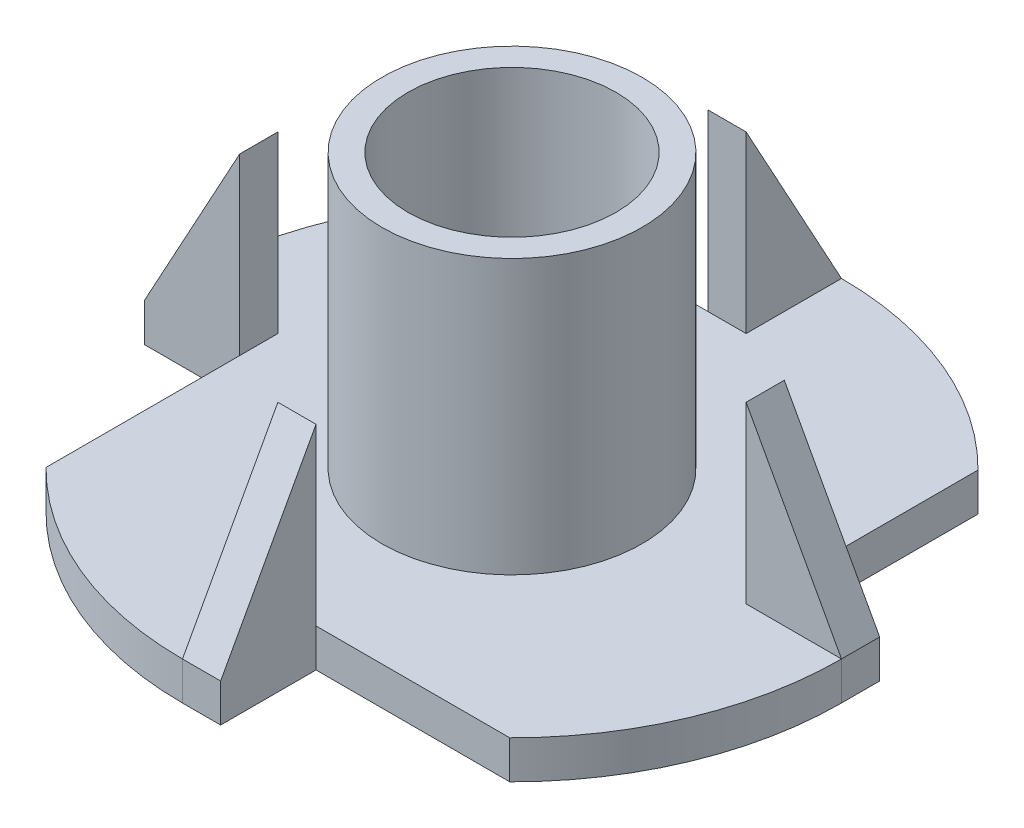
ISO-10303-21;
HEADER;
FILE_DESCRIPTION(('STEP AP214'),'2;1');
FILE_NAME('part.step','',(''),(''),'','','');
FILE_SCHEMA(('AUTOMOTIVE_DESIGN { 1 0 10303 214 1 1 1 1 }'));
ENDSEC;
DATA;
#1=APPLICATION_CONTEXT('core data for automotive mechanical design processes');
#2=APPLICATION_PROTOCOL_DEFINITION('international standard','automotive_design',2000,#1);
#3=PRODUCT_CONTEXT('',#1,'mechanical');
#4=PRODUCT('Part','Part','',(#3));
#5=PRODUCT_RELATED_PRODUCT_CATEGORY('part','',(#4));
#6=PRODUCT_DEFINITION_FORMATION('','',#4);
#7=PRODUCT_DEFINITION_CONTEXT('part definition',#1,'design');
#8=PRODUCT_DEFINITION('design','',#6,#7);
#9=PRODUCT_DEFINITION_SHAPE('','',#8);
#10=(LENGTH_UNIT() NAMED_UNIT(*) SI_UNIT(.MILLI.,.METRE.));
#11=(NAMED_UNIT(*) PLANE_ANGLE_UNIT() SI_UNIT($,.RADIAN.));
#12=(NAMED_UNIT(*) SI_UNIT($,.STERADIAN.) SOLID_ANGLE_UNIT());
#13=UNCERTAINTY_MEASURE_WITH_UNIT(LENGTH_MEASURE(1.E-05),#10,'distance_accuracy_value','');
#14=(GEOMETRIC_REPRESENTATION_CONTEXT(3) GLOBAL_UNCERTAINTY_ASSIGNED_CONTEXT((#13)) GLOBAL_UNIT_ASSIGNED_CONTEXT((#10,
#11,#12)) REPRESENTATION_CONTEXT('',''));
#15=CARTESIAN_POINT('',(0.,0.,0.));
#16=DIRECTION('',(0.,0.,1.));
#17=DIRECTION('',(1.,0.,0.));
#18=AXIS2_PLACEMENT_3D('',#15,#16,#17);
#19=CARTESIAN_POINT('',(0.,0.,0.));
#20=DIRECTION('',(0.,-1.,0.));
#21=DIRECTION('',(0.,0.,-1.));
#22=AXIS2_PLACEMENT_3D('',#19,#20,#21);
#23=CYLINDRICAL_SURFACE('',#22,9.5);
#24=CARTESIAN_POINT('',(0.,1.1,0.));
#25=DIRECTION('',(0.,-1.,0.));
#26=DIRECTION('',(0.,0.,-1.));
#27=AXIS2_PLACEMENT_3D('',#24,#25,#26);
#28=CIRCLE('',#27,9.5);
#29=CARTESIAN_POINT('',(0.,1.1,9.5));
#30=VERTEX_POINT('',#29);
#31=CARTESIAN_POINT('',(-6.75,1.1,6.68487097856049));
#32=VERTEX_POINT('',#31);
#33=EDGE_CURVE('E326',#30,#32,#28,.T.);
#34=ORIENTED_EDGE('',*,*,#33,.T.);
#35=DIRECTION('',(0.,-1.,0.));
#36=VECTOR('',#35,1.);
#37=CARTESIAN_POINT('',(-6.75,9.,6.68487097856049));
#38=LINE('',#37,#36);
#39=CARTESIAN_POINT('',(-6.75,0.,6.68487097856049));
#40=VERTEX_POINT('',#39);
#41=EDGE_CURVE('E293',#32,#40,#38,.T.);
#42=ORIENTED_EDGE('',*,*,#41,.T.);
#43=CARTESIAN_POINT('',(0.,0.,0.));
#44=DIRECTION('',(0.,-1.,0.));
#45=DIRECTION('',(0.,0.,-1.));
#46=AXIS2_PLACEMENT_3D('',#43,#44,#45);
#47=CIRCLE('',#46,9.5);
#48=CARTESIAN_POINT('',(0.,0.,9.5));
#49=VERTEX_POINT('',#48);
#50=EDGE_CURVE('E321',#49,#40,#47,.T.);
#51=ORIENTED_EDGE('',*,*,#50,.F.);
#52=DIRECTION('',(0.,-1.,0.));
#53=VECTOR('',#52,1.);
#54=CARTESIAN_POINT('',(0.,0.,9.5));
#55=LINE('',#54,#53);
#56=EDGE_CURVE('E345',#30,#49,#55,.T.);
#57=ORIENTED_EDGE('',*,*,#56,.F.);
#58=EDGE_LOOP('',(#34,#42,#51,#57));
#59=FACE_BOUND('',#58,.T.);
#60=ADVANCED_FACE('F37',(#59),#23,.T.);
#61=DIRECTION('',(0.,-1.,0.));
#62=VECTOR('',#61,1.);
#63=CARTESIAN_POINT('',(0.,9.,-9.5));
#64=LINE('',#63,#62);
#65=CARTESIAN_POINT('',(0.,1.1,-9.5));
#66=VERTEX_POINT('',#65);
#67=CARTESIAN_POINT('',(0.,0.,-9.5));
#68=VERTEX_POINT('',#67);
#69=EDGE_CURVE('E301',#66,#68,#64,.T.);
#70=ORIENTED_EDGE('',*,*,#69,.F.);
#71=CARTESIAN_POINT('',(6.75,1.1,-6.68487097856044));
#72=VERTEX_POINT('',#71);
#73=EDGE_CURVE('E402',#66,#72,#28,.T.);
#74=ORIENTED_EDGE('',*,*,#73,.T.);
#75=DIRECTION('',(0.,-1.,0.));
#76=VECTOR('',#75,1.);
#77=CARTESIAN_POINT('',(6.75,9.,-6.68487097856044));
#78=LINE('',#77,#76);
#79=CARTESIAN_POINT('',(6.75,0.,-6.68487097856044));
#80=VERTEX_POINT('',#79);
#81=EDGE_CURVE('E307',#72,#80,#78,.T.);
#82=ORIENTED_EDGE('',*,*,#81,.T.);
#83=EDGE_CURVE('E418',#68,#80,#47,.T.);
#84=ORIENTED_EDGE('',*,*,#83,.F.);
#85=EDGE_LOOP('',(#70,#74,#82,#84));
#86=FACE_BOUND('',#85,.T.);
#87=ADVANCED_FACE('F446',(#86),#23,.T.);
#88=CARTESIAN_POINT('',(-9.5,0.,0.));
#89=VERTEX_POINT('',#88);
#90=CARTESIAN_POINT('',(-6.68487097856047,0.,-6.75));
#91=VERTEX_POINT('',#90);
#92=EDGE_CURVE('E325',#89,#91,#47,.T.);
#93=ORIENTED_EDGE('',*,*,#92,.F.);
#94=DIRECTION('',(0.,-1.,0.));
#95=VECTOR('',#94,1.);
#96=CARTESIAN_POINT('',(-9.5,9.,0.));
#97=LINE('',#96,#95);
#98=CARTESIAN_POINT('',(-9.5,1.1,0.));
#99=VERTEX_POINT('',#98);
#100=EDGE_CURVE('E292',#99,#89,#97,.T.);
#101=ORIENTED_EDGE('',*,*,#100,.F.);
#102=CARTESIAN_POINT('',(-6.68487097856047,1.1,-6.75));
#103=VERTEX_POINT('',#102);
#104=EDGE_CURVE('E330',#99,#103,#28,.T.);
#105=ORIENTED_EDGE('',*,*,#104,.T.);
#106=DIRECTION('',(0.,-1.,0.));
#107=VECTOR('',#106,1.);
#108=CARTESIAN_POINT('',(-6.68487097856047,9.,-6.75));
#109=LINE('',#108,#107);
#110=EDGE_CURVE('E300',#103,#91,#109,.T.);
#111=ORIENTED_EDGE('',*,*,#110,.T.);
#112=EDGE_LOOP('',(#93,#101,#105,#111));
#113=FACE_BOUND('',#112,.T.);
#114=ADVANCED_FACE('F410',(#113),#23,.T.);
#115=CARTESIAN_POINT('',(9.5,0.,0.));
#116=VERTEX_POINT('',#115);
#117=CARTESIAN_POINT('',(6.68487097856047,0.,6.75));
#118=VERTEX_POINT('',#117);
#119=EDGE_CURVE('E320',#116,#118,#47,.T.);
#120=ORIENTED_EDGE('',*,*,#119,.F.);
#121=DIRECTION('',(0.,-1.,0.));
#122=VECTOR('',#121,1.);
#123=CARTESIAN_POINT('',(9.5,9.,0.));
#124=LINE('',#123,#122);
#125=CARTESIAN_POINT('',(9.5,1.1,0.));
#126=VERTEX_POINT('',#125);
#127=EDGE_CURVE('E208',#126,#116,#124,.T.);
#128=ORIENTED_EDGE('',*,*,#127,.F.);
#129=CARTESIAN_POINT('',(6.68487097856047,1.1,6.75));
#130=VERTEX_POINT('',#129);
#131=EDGE_CURVE('E324',#126,#130,#28,.T.);
#132=ORIENTED_EDGE('',*,*,#131,.T.);
#133=DIRECTION('',(0.,-1.,0.));
#134=VECTOR('',#133,1.);
#135=CARTESIAN_POINT('',(6.68487097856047,0.,6.75));
#136=LINE('',#135,#134);
#137=EDGE_CURVE('E342',#130,#118,#136,.T.);
#138=ORIENTED_EDGE('',*,*,#137,.T.);
#139=EDGE_LOOP('',(#120,#128,#132,#138));
#140=FACE_BOUND('',#139,.T.);
#141=ADVANCED_FACE('F400',(#140),#23,.T.);
#142=CARTESIAN_POINT('',(-9.5,0.,0.));
#143=DIRECTION('',(0.,1.,0.));
#144=DIRECTION('',(0.,0.,1.));
#145=AXIS2_PLACEMENT_3D('',#142,#143,#144);
#146=PLANE('',#145);
#147=DIRECTION('',(0.,0.,-1.));
#148=VECTOR('',#147,1.);
#149=CARTESIAN_POINT('',(6.75,0.,0.));
#150=LINE('',#149,#148);
#151=CARTESIAN_POINT('',(6.75,0.,-1.09999999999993));
#152=VERTEX_POINT('',#151);
#153=EDGE_CURVE('E193',#152,#80,#150,.T.);
#154=ORIENTED_EDGE('',*,*,#153,.F.);
#155=DIRECTION('',(-1.,0.,0.));
#156=VECTOR('',#155,1.);
#157=CARTESIAN_POINT('',(9.50000000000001,0.,-1.0999999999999));
#158=LINE('',#157,#156);
#159=CARTESIAN_POINT('',(9.50000000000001,0.,-1.0999999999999));
#160=VERTEX_POINT('',#159);
#161=EDGE_CURVE('E185',#160,#152,#158,.T.);
#162=ORIENTED_EDGE('',*,*,#161,.F.);
#163=DIRECTION('',(0.,0.,1.));
#164=VECTOR('',#163,1.);
#165=CARTESIAN_POINT('',(9.50000000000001,0.,-1.0999999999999));
#166=LINE('',#165,#164);
#167=EDGE_CURVE('E190',#160,#116,#166,.T.);
#168=ORIENTED_EDGE('',*,*,#167,.T.);
#169=ORIENTED_EDGE('',*,*,#119,.T.);
#170=DIRECTION('',(1.,0.,0.));
#171=VECTOR('',#170,1.);
#172=CARTESIAN_POINT('',(0.,0.,6.75));
#173=LINE('',#172,#171);
#174=CARTESIAN_POINT('',(1.1,0.,6.75));
#175=VERTEX_POINT('',#174);
#176=EDGE_CURVE('E310',#175,#118,#173,.T.);
#177=ORIENTED_EDGE('',*,*,#176,.F.);
#178=DIRECTION('',(0.,0.,-1.));
#179=VECTOR('',#178,1.);
#180=CARTESIAN_POINT('',(1.1,0.,9.5));
#181=LINE('',#180,#179);
#182=CARTESIAN_POINT('',(1.1,0.,9.5));
#183=VERTEX_POINT('',#182);
#184=EDGE_CURVE('E270',#183,#175,#181,.T.);
#185=ORIENTED_EDGE('',*,*,#184,.F.);
#186=DIRECTION('',(-1.,0.,0.));
#187=VECTOR('',#186,1.);
#188=CARTESIAN_POINT('',(1.1,0.,9.5));
#189=LINE('',#188,#187);
#190=EDGE_CURVE('E288',#183,#49,#189,.T.);
#191=ORIENTED_EDGE('',*,*,#190,.T.);
#192=ORIENTED_EDGE('',*,*,#50,.T.);
#193=DIRECTION('',(0.,0.,1.));
#194=VECTOR('',#193,1.);
#195=CARTESIAN_POINT('',(-6.75,0.,0.));
#196=LINE('',#195,#194);
#197=CARTESIAN_POINT('',(-6.75,0.,1.09999999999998));
#198=VERTEX_POINT('',#197);
#199=EDGE_CURVE('E290',#198,#40,#196,.T.);
#200=ORIENTED_EDGE('',*,*,#199,.F.);
#201=DIRECTION('',(1.,0.,0.));
#202=VECTOR('',#201,1.);
#203=CARTESIAN_POINT('',(-9.5,0.,1.09999999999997));
#204=LINE('',#203,#202);
#205=CARTESIAN_POINT('',(-9.5,0.,1.09999999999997));
#206=VERTEX_POINT('',#205);
#207=EDGE_CURVE('E244',#206,#198,#204,.T.);
#208=ORIENTED_EDGE('',*,*,#207,.F.);
#209=DIRECTION('',(0.,0.,-1.));
#210=VECTOR('',#209,1.);
#211=CARTESIAN_POINT('',(-9.5,0.,1.09999999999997));
#212=LINE('',#211,#210);
#213=EDGE_CURVE('E263',#206,#89,#212,.T.);
#214=ORIENTED_EDGE('',*,*,#213,.T.);
#215=ORIENTED_EDGE('',*,*,#92,.T.);
#216=DIRECTION('',(-1.,0.,0.));
#217=VECTOR('',#216,1.);
#218=CARTESIAN_POINT('',(0.,0.,-6.75));
#219=LINE('',#218,#217);
#220=CARTESIAN_POINT('',(-1.1,0.,-6.75));
#221=VERTEX_POINT('',#220);
#222=EDGE_CURVE('E296',#221,#91,#219,.T.);
#223=ORIENTED_EDGE('',*,*,#222,.F.);
#224=DIRECTION('',(0.,0.,1.));
#225=VECTOR('',#224,1.);
#226=CARTESIAN_POINT('',(-1.1,0.,-9.5));
#227=LINE('',#226,#225);
#228=CARTESIAN_POINT('',(-1.1,0.,-9.5));
#229=VERTEX_POINT('',#228);
#230=EDGE_CURVE('E222',#229,#221,#227,.T.);
#231=ORIENTED_EDGE('',*,*,#230,.F.);
#232=DIRECTION('',(1.,0.,0.));
#233=VECTOR('',#232,1.);
#234=CARTESIAN_POINT('',(-1.1,0.,-9.5));
#235=LINE('',#234,#233);
#236=EDGE_CURVE('E238',#229,#68,#235,.T.);
#237=ORIENTED_EDGE('',*,*,#236,.T.);
#238=ORIENTED_EDGE('',*,*,#83,.T.);
#239=EDGE_LOOP('',(#154,#162,#168,#169,#177,#185,#191,#192,#200,#208,#214,#215,#223,#231,#237,#238));
#240=FACE_BOUND('',#239,.T.);
#241=CARTESIAN_POINT('',(0.,0.,0.));
#242=DIRECTION('',(0.,-1.,0.));
#243=DIRECTION('',(0.,0.,-1.));
#244=AXIS2_PLACEMENT_3D('',#241,#242,#243);
#245=CIRCLE('',#244,3.);
#246=CARTESIAN_POINT('',(0.,0.,-3.));
#247=VERTEX_POINT('',#246);
#248=EDGE_CURVE('E339',#247,#247,#245,.T.);
#249=ORIENTED_EDGE('',*,*,#248,.F.);
#250=EDGE_LOOP('',(#249));
#251=FACE_BOUND('',#250,.T.);
#252=ADVANCED_FACE('F39',(#240,#251),#146,.F.);
#253=CARTESIAN_POINT('',(0.,0.,0.));
#254=DIRECTION('',(0.,-1.,0.));
#255=DIRECTION('',(0.,0.,-1.));
#256=AXIS2_PLACEMENT_3D('',#253,#254,#255);
#257=CYLINDRICAL_SURFACE('',#256,3.);
#258=CARTESIAN_POINT('',(0.,9.,0.));
#259=DIRECTION('',(0.,-1.,0.));
#260=DIRECTION('',(0.,0.,-1.));
#261=AXIS2_PLACEMENT_3D('',#258,#259,#260);
#262=CIRCLE('',#261,3.);
#263=CARTESIAN_POINT('',(0.,9.,-3.));
#264=VERTEX_POINT('',#263);
#265=EDGE_CURVE('E336',#264,#264,#262,.T.);
#266=ORIENTED_EDGE('',*,*,#265,.F.);
#267=EDGE_LOOP('',(#266));
#268=FACE_BOUND('',#267,.T.);
#269=ORIENTED_EDGE('',*,*,#248,.T.);
#270=EDGE_LOOP('',(#269));
#271=FACE_BOUND('',#270,.T.);
#272=ADVANCED_FACE('F458',(#268,#271),#257,.F.);
#273=CARTESIAN_POINT('',(-3.,9.,0.));
#274=DIRECTION('',(0.,-1.,0.));
#275=DIRECTION('',(0.,0.,-1.));
#276=AXIS2_PLACEMENT_3D('',#273,#274,#275);
#277=PLANE('',#276);
#278=CARTESIAN_POINT('',(0.,9.,0.));
#279=DIRECTION('',(0.,-1.,0.));
#280=DIRECTION('',(0.,0.,-1.));
#281=AXIS2_PLACEMENT_3D('',#278,#279,#280);
#282=CIRCLE('',#281,3.75);
#283=CARTESIAN_POINT('',(0.,9.,-3.75));
#284=VERTEX_POINT('',#283);
#285=EDGE_CURVE('E333',#284,#284,#282,.T.);
#286=ORIENTED_EDGE('',*,*,#285,.F.);
#287=EDGE_LOOP('',(#286));
#288=FACE_BOUND('',#287,.T.);
#289=ORIENTED_EDGE('',*,*,#265,.T.);
#290=EDGE_LOOP('',(#289));
#291=FACE_BOUND('',#290,.T.);
#292=ADVANCED_FACE('F533',(#288,#291),#277,.F.);
#293=CARTESIAN_POINT('',(0.,0.,0.));
#294=DIRECTION('',(0.,-1.,0.));
#295=DIRECTION('',(0.,0.,-1.));
#296=AXIS2_PLACEMENT_3D('',#293,#294,#295);
#297=CYLINDRICAL_SURFACE('',#296,3.75);
#298=CARTESIAN_POINT('',(0.,1.1,0.));
#299=DIRECTION('',(0.,-1.,0.));
#300=DIRECTION('',(0.,0.,-1.));
#301=AXIS2_PLACEMENT_3D('',#298,#299,#300);
#302=CIRCLE('',#301,3.75);
#303=CARTESIAN_POINT('',(0.,1.1,-3.75));
#304=VERTEX_POINT('',#303);
#305=EDGE_CURVE('E329',#304,#304,#302,.T.);
#306=ORIENTED_EDGE('',*,*,#305,.F.);
#307=EDGE_LOOP('',(#306));
#308=FACE_BOUND('',#307,.T.);
#309=ORIENTED_EDGE('',*,*,#285,.T.);
#310=EDGE_LOOP('',(#309));
#311=FACE_BOUND('',#310,.T.);
#312=ADVANCED_FACE('F528',(#308,#311),#297,.T.);
#313=CARTESIAN_POINT('',(-3.75,1.1,0.));
#314=DIRECTION('',(0.,-1.,0.));
#315=DIRECTION('',(0.,0.,-1.));
#316=AXIS2_PLACEMENT_3D('',#313,#314,#315);
#317=PLANE('',#316);
#318=DIRECTION('',(1.,0.,0.));
#319=VECTOR('',#318,1.);
#320=CARTESIAN_POINT('',(-3.75,1.1,0.));
#321=LINE('',#320,#319);
#322=CARTESIAN_POINT('',(-6.75,1.1,0.));
#323=VERTEX_POINT('',#322);
#324=EDGE_CURVE('E358',#99,#323,#321,.T.);
#325=ORIENTED_EDGE('',*,*,#324,.T.);
#326=DIRECTION('',(0.,0.,1.));
#327=VECTOR('',#326,1.);
#328=CARTESIAN_POINT('',(-6.75,1.1,0.));
#329=LINE('',#328,#327);
#330=CARTESIAN_POINT('',(-6.75,1.1,1.09999999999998));
#331=VERTEX_POINT('',#330);
#332=EDGE_CURVE('E11',#323,#331,#329,.T.);
#333=ORIENTED_EDGE('',*,*,#332,.T.);
#334=EDGE_CURVE('E45',#331,#32,#329,.T.);
#335=ORIENTED_EDGE('',*,*,#334,.T.);
#336=ORIENTED_EDGE('',*,*,#33,.F.);
#337=DIRECTION('',(0.,0.,-1.));
#338=VECTOR('',#337,1.);
#339=CARTESIAN_POINT('',(0.,1.1,0.));
#340=LINE('',#339,#338);
#341=CARTESIAN_POINT('',(0.,1.1,6.75));
#342=VERTEX_POINT('',#341);
#343=EDGE_CURVE('E317',#30,#342,#340,.T.);
#344=ORIENTED_EDGE('',*,*,#343,.T.);
#345=DIRECTION('',(1.,0.,0.));
#346=VECTOR('',#345,1.);
#347=CARTESIAN_POINT('',(-3.75,1.1,6.75));
#348=LINE('',#347,#346);
#349=CARTESIAN_POINT('',(1.1,1.1,6.75));
#350=VERTEX_POINT('',#349);
#351=EDGE_CURVE('E314',#342,#350,#348,.T.);
#352=ORIENTED_EDGE('',*,*,#351,.T.);
#353=EDGE_CURVE('E313',#350,#130,#348,.T.);
#354=ORIENTED_EDGE('',*,*,#353,.T.);
#355=ORIENTED_EDGE('',*,*,#131,.F.);
#356=DIRECTION('',(-1.,0.,0.));
#357=VECTOR('',#356,1.);
#358=CARTESIAN_POINT('',(-3.75,1.1,0.));
#359=LINE('',#358,#357);
#360=CARTESIAN_POINT('',(6.75,1.1,0.));
#361=VERTEX_POINT('',#360);
#362=EDGE_CURVE('E348',#126,#361,#359,.T.);
#363=ORIENTED_EDGE('',*,*,#362,.T.);
#364=DIRECTION('',(0.,0.,-1.));
#365=VECTOR('',#364,1.);
#366=CARTESIAN_POINT('',(6.75,1.1,0.));
#367=LINE('',#366,#365);
#368=CARTESIAN_POINT('',(6.75,1.1,-1.09999999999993));
#369=VERTEX_POINT('',#368);
#370=EDGE_CURVE('E350',#361,#369,#367,.T.);
#371=ORIENTED_EDGE('',*,*,#370,.T.);
#372=EDGE_CURVE('E52',#369,#72,#367,.T.);
#373=ORIENTED_EDGE('',*,*,#372,.T.);
#374=ORIENTED_EDGE('',*,*,#73,.F.);
#375=DIRECTION('',(0.,0.,1.));
#376=VECTOR('',#375,1.);
#377=CARTESIAN_POINT('',(0.,1.1,0.));
#378=LINE('',#377,#376);
#379=CARTESIAN_POINT('',(0.,1.1,-6.75));
#380=VERTEX_POINT('',#379);
#381=EDGE_CURVE('E356',#66,#380,#378,.T.);
#382=ORIENTED_EDGE('',*,*,#381,.T.);
#383=DIRECTION('',(-1.,0.,0.));
#384=VECTOR('',#383,1.);
#385=CARTESIAN_POINT('',(-3.75,1.1,-6.75));
#386=LINE('',#385,#384);
#387=CARTESIAN_POINT('',(-1.1,1.1,-6.75));
#388=VERTEX_POINT('',#387);
#389=EDGE_CURVE('E353',#380,#388,#386,.T.);
#390=ORIENTED_EDGE('',*,*,#389,.T.);
#391=EDGE_CURVE('E352',#388,#103,#386,.T.);
#392=ORIENTED_EDGE('',*,*,#391,.T.);
#393=ORIENTED_EDGE('',*,*,#104,.F.);
#394=EDGE_LOOP('',(#325,#333,#335,#336,#344,#352,#354,#355,#363,#371,#373,#374,#382,#390,#392,#393));
#395=FACE_BOUND('',#394,.T.);
#396=ORIENTED_EDGE('',*,*,#305,.T.);
#397=EDGE_LOOP('',(#396));
#398=FACE_BOUND('',#397,.T.);
#399=ADVANCED_FACE('F365',(#395,#398),#317,.F.);
#400=CARTESIAN_POINT('',(0.,9.,6.75));
#401=DIRECTION('',(0.,0.,-1.));
#402=DIRECTION('',(-1.,0.,0.));
#403=AXIS2_PLACEMENT_3D('',#400,#401,#402);
#404=PLANE('',#403);
#405=ORIENTED_EDGE('',*,*,#353,.F.);
#406=DIRECTION('',(0.,1.,0.));
#407=VECTOR('',#406,1.);
#408=CARTESIAN_POINT('',(1.1,6.13487097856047,6.75));
#409=LINE('',#408,#407);
#410=EDGE_CURVE('E274',#175,#350,#409,.T.);
#411=ORIENTED_EDGE('',*,*,#410,.F.);
#412=ORIENTED_EDGE('',*,*,#176,.T.);
#413=ORIENTED_EDGE('',*,*,#137,.F.);
#414=EDGE_LOOP('',(#405,#411,#412,#413));
#415=FACE_BOUND('',#414,.T.);
#416=ADVANCED_FACE('F398',(#415),#404,.F.);
#417=CARTESIAN_POINT('',(6.75,9.,0.));
#418=DIRECTION('',(-1.,0.,0.));
#419=DIRECTION('',(0.,0.,1.));
#420=AXIS2_PLACEMENT_3D('',#417,#418,#419);
#421=PLANE('',#420);
#422=ORIENTED_EDGE('',*,*,#372,.F.);
#423=DIRECTION('',(0.,1.,0.));
#424=VECTOR('',#423,1.);
#425=CARTESIAN_POINT('',(6.75000000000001,6.13487097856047,-1.09999999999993));
#426=LINE('',#425,#424);
#427=EDGE_CURVE('E57',#152,#369,#426,.T.);
#428=ORIENTED_EDGE('',*,*,#427,.F.);
#429=ORIENTED_EDGE('',*,*,#153,.T.);
#430=ORIENTED_EDGE('',*,*,#81,.F.);
#431=EDGE_LOOP('',(#422,#428,#429,#430));
#432=FACE_BOUND('',#431,.T.);
#433=ADVANCED_FACE('F517',(#432),#421,.F.);
#434=CARTESIAN_POINT('',(0.,9.,-6.75));
#435=DIRECTION('',(0.,0.,1.));
#436=DIRECTION('',(1.,0.,0.));
#437=AXIS2_PLACEMENT_3D('',#434,#435,#436);
#438=PLANE('',#437);
#439=ORIENTED_EDGE('',*,*,#391,.F.);
#440=DIRECTION('',(0.,1.,0.));
#441=VECTOR('',#440,1.);
#442=CARTESIAN_POINT('',(-1.1,6.13487097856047,-6.75));
#443=LINE('',#442,#441);
#444=EDGE_CURVE('E225',#221,#388,#443,.T.);
#445=ORIENTED_EDGE('',*,*,#444,.F.);
#446=ORIENTED_EDGE('',*,*,#222,.T.);
#447=ORIENTED_EDGE('',*,*,#110,.F.);
#448=EDGE_LOOP('',(#439,#445,#446,#447));
#449=FACE_BOUND('',#448,.T.);
#450=ADVANCED_FACE('F413',(#449),#438,.F.);
#451=CARTESIAN_POINT('',(-6.75,9.,0.));
#452=DIRECTION('',(1.,0.,0.));
#453=DIRECTION('',(0.,0.,-1.));
#454=AXIS2_PLACEMENT_3D('',#451,#452,#453);
#455=PLANE('',#454);
#456=ORIENTED_EDGE('',*,*,#334,.F.);
#457=DIRECTION('',(0.,1.,0.));
#458=VECTOR('',#457,1.);
#459=CARTESIAN_POINT('',(-6.75,6.13487097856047,1.09999999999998));
#460=LINE('',#459,#458);
#461=EDGE_CURVE('E249',#198,#331,#460,.T.);
#462=ORIENTED_EDGE('',*,*,#461,.F.);
#463=ORIENTED_EDGE('',*,*,#199,.T.);
#464=ORIENTED_EDGE('',*,*,#41,.F.);
#465=EDGE_LOOP('',(#456,#462,#463,#464));
#466=FACE_BOUND('',#465,.T.);
#467=ADVANCED_FACE('F369',(#466),#455,.F.);
#468=CARTESIAN_POINT('',(1.1,6.13487097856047,6.75));
#469=DIRECTION('',(0.,0.,1.));
#470=DIRECTION('',(1.,0.,0.));
#471=AXIS2_PLACEMENT_3D('',#468,#469,#470);
#472=PLANE('',#471);
#473=CARTESIAN_POINT('',(1.1,6.13487097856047,6.75));
#474=VERTEX_POINT('',#473);
#475=EDGE_CURVE('E273',#350,#474,#409,.T.);
#476=ORIENTED_EDGE('',*,*,#475,.F.);
#477=ORIENTED_EDGE('',*,*,#351,.F.);
#478=DIRECTION('',(0.,1.,0.));
#479=VECTOR('',#478,1.);
#480=CARTESIAN_POINT('',(0.,6.13487097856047,6.75));
#481=LINE('',#480,#479);
#482=CARTESIAN_POINT('',(0.,6.13487097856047,6.75));
#483=VERTEX_POINT('',#482);
#484=EDGE_CURVE('E266',#342,#483,#481,.T.);
#485=ORIENTED_EDGE('',*,*,#484,.T.);
#486=DIRECTION('',(-1.,0.,0.));
#487=VECTOR('',#486,1.);
#488=CARTESIAN_POINT('',(1.1,6.13487097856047,6.75));
#489=LINE('',#488,#487);
#490=EDGE_CURVE('E285',#474,#483,#489,.T.);
#491=ORIENTED_EDGE('',*,*,#490,.F.);
#492=EDGE_LOOP('',(#476,#477,#485,#491));
#493=FACE_BOUND('',#492,.T.);
#494=ADVANCED_FACE('F391',(#493),#472,.F.);
#495=CARTESIAN_POINT('',(0.,0.,9.5));
#496=DIRECTION('',(1.,0.,0.));
#497=DIRECTION('',(0.,0.,-1.));
#498=AXIS2_PLACEMENT_3D('',#495,#496,#497);
#499=PLANE('',#498);
#500=ORIENTED_EDGE('',*,*,#484,.F.);
#501=ORIENTED_EDGE('',*,*,#343,.F.);
#502=DIRECTION('',(0.,-0.877623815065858,0.47935001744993));
#503=VECTOR('',#502,1.);
#504=CARTESIAN_POINT('',(0.,1.1,9.5));
#505=LINE('',#504,#503);
#506=EDGE_CURVE('E271',#483,#30,#505,.T.);
#507=ORIENTED_EDGE('',*,*,#506,.F.);
#508=EDGE_LOOP('',(#500,#501,#507));
#509=FACE_BOUND('',#508,.T.);
#510=ADVANCED_FACE('F386',(#509),#499,.F.);
#511=CARTESIAN_POINT('',(1.1,1.1,9.5));
#512=DIRECTION('',(0.,0.,-1.));
#513=DIRECTION('',(-1.,0.,0.));
#514=AXIS2_PLACEMENT_3D('',#511,#512,#513);
#515=PLANE('',#514);
#516=ORIENTED_EDGE('',*,*,#56,.T.);
#517=ORIENTED_EDGE('',*,*,#190,.F.);
#518=DIRECTION('',(0.,-1.,0.));
#519=VECTOR('',#518,1.);
#520=CARTESIAN_POINT('',(1.1,1.1,9.5));
#521=LINE('',#520,#519);
#522=CARTESIAN_POINT('',(1.1,1.1,9.5));
#523=VERTEX_POINT('',#522);
#524=EDGE_CURVE('E267',#523,#183,#521,.T.);
#525=ORIENTED_EDGE('',*,*,#524,.F.);
#526=DIRECTION('',(-1.,0.,0.));
#527=VECTOR('',#526,1.);
#528=CARTESIAN_POINT('',(1.1,1.1,9.5));
#529=LINE('',#528,#527);
#530=EDGE_CURVE('E279',#523,#30,#529,.T.);
#531=ORIENTED_EDGE('',*,*,#530,.T.);
#532=EDGE_LOOP('',(#516,#517,#525,#531));
#533=FACE_BOUND('',#532,.T.);
#534=ADVANCED_FACE('F376',(#533),#515,.F.);
#535=CARTESIAN_POINT('',(1.1,1.1,9.5));
#536=DIRECTION('',(0.,-0.47935001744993,-0.877623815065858));
#537=DIRECTION('',(0.,0.877623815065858,-0.47935001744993));
#538=AXIS2_PLACEMENT_3D('',#535,#536,#537);
#539=PLANE('',#538);
#540=ORIENTED_EDGE('',*,*,#506,.T.);
#541=ORIENTED_EDGE('',*,*,#530,.F.);
#542=DIRECTION('',(0.,-0.877623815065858,0.47935001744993));
#543=VECTOR('',#542,1.);
#544=CARTESIAN_POINT('',(1.1,1.1,9.5));
#545=LINE('',#544,#543);
#546=EDGE_CURVE('E277',#474,#523,#545,.T.);
#547=ORIENTED_EDGE('',*,*,#546,.F.);
#548=ORIENTED_EDGE('',*,*,#490,.T.);
#549=EDGE_LOOP('',(#540,#541,#547,#548));
#550=FACE_BOUND('',#549,.T.);
#551=ADVANCED_FACE('F381',(#550),#539,.F.);
#552=CARTESIAN_POINT('',(1.1,0.,9.5));
#553=DIRECTION('',(1.,0.,0.));
#554=DIRECTION('',(0.,0.,-1.));
#555=AXIS2_PLACEMENT_3D('',#552,#553,#554);
#556=PLANE('',#555);
#557=ORIENTED_EDGE('',*,*,#524,.T.);
#558=ORIENTED_EDGE('',*,*,#184,.T.);
#559=ORIENTED_EDGE('',*,*,#410,.T.);
#560=ORIENTED_EDGE('',*,*,#475,.T.);
#561=ORIENTED_EDGE('',*,*,#546,.T.);
#562=EDGE_LOOP('',(#557,#558,#559,#560,#561));
#563=FACE_BOUND('',#562,.T.);
#564=ADVANCED_FACE('F394',(#563),#556,.T.);
#565=CARTESIAN_POINT('',(-9.5,0.,0.));
#566=DIRECTION('',(0.,0.,1.));
#567=DIRECTION('',(1.,0.,0.));
#568=AXIS2_PLACEMENT_3D('',#565,#566,#567);
#569=PLANE('',#568);
#570=DIRECTION('',(0.,1.,0.));
#571=VECTOR('',#570,1.);
#572=CARTESIAN_POINT('',(-6.75,6.13487097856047,0.));
#573=LINE('',#572,#571);
#574=CARTESIAN_POINT('',(-6.75,6.13487097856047,0.));
#575=VERTEX_POINT('',#574);
#576=EDGE_CURVE('E240',#323,#575,#573,.T.);
#577=ORIENTED_EDGE('',*,*,#576,.F.);
#578=ORIENTED_EDGE('',*,*,#324,.F.);
#579=DIRECTION('',(-0.47935001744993,-0.877623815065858,0.));
#580=VECTOR('',#579,1.);
#581=CARTESIAN_POINT('',(-9.5,1.1,0.));
#582=LINE('',#581,#580);
#583=EDGE_CURVE('E245',#575,#99,#582,.T.);
#584=ORIENTED_EDGE('',*,*,#583,.F.);
#585=EDGE_LOOP('',(#577,#578,#584));
#586=FACE_BOUND('',#585,.T.);
#587=ADVANCED_FACE('F433',(#586),#569,.F.);
#588=CARTESIAN_POINT('',(-6.75,6.13487097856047,1.09999999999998));
#589=DIRECTION('',(-1.,0.,0.));
#590=DIRECTION('',(0.,0.,1.));
#591=AXIS2_PLACEMENT_3D('',#588,#589,#590);
#592=PLANE('',#591);
#593=CARTESIAN_POINT('',(-6.75,6.13487097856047,1.09999999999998));
#594=VERTEX_POINT('',#593);
#595=EDGE_CURVE('E248',#331,#594,#460,.T.);
#596=ORIENTED_EDGE('',*,*,#595,.F.);
#597=ORIENTED_EDGE('',*,*,#332,.F.);
#598=ORIENTED_EDGE('',*,*,#576,.T.);
#599=DIRECTION('',(0.,0.,-1.));
#600=VECTOR('',#599,1.);
#601=CARTESIAN_POINT('',(-6.75,6.13487097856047,1.09999999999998));
#602=LINE('',#601,#600);
#603=EDGE_CURVE('E260',#594,#575,#602,.T.);
#604=ORIENTED_EDGE('',*,*,#603,.F.);
#605=EDGE_LOOP('',(#596,#597,#598,#604));
#606=FACE_BOUND('',#605,.T.);
#607=ADVANCED_FACE('F435',(#606),#592,.F.);
#608=CARTESIAN_POINT('',(-9.5,1.1,1.09999999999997));
#609=DIRECTION('',(1.,0.,0.));
#610=DIRECTION('',(0.,0.,-1.));
#611=AXIS2_PLACEMENT_3D('',#608,#609,#610);
#612=PLANE('',#611);
#613=ORIENTED_EDGE('',*,*,#100,.T.);
#614=ORIENTED_EDGE('',*,*,#213,.F.);
#615=DIRECTION('',(0.,-1.,0.));
#616=VECTOR('',#615,1.);
#617=CARTESIAN_POINT('',(-9.5,1.1,1.09999999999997));
#618=LINE('',#617,#616);
#619=CARTESIAN_POINT('',(-9.5,1.1,1.09999999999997));
#620=VERTEX_POINT('',#619);
#621=EDGE_CURVE('E241',#620,#206,#618,.T.);
#622=ORIENTED_EDGE('',*,*,#621,.F.);
#623=DIRECTION('',(0.,0.,-1.));
#624=VECTOR('',#623,1.);
#625=CARTESIAN_POINT('',(-9.5,1.1,1.09999999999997));
#626=LINE('',#625,#624);
#627=EDGE_CURVE('E254',#620,#99,#626,.T.);
#628=ORIENTED_EDGE('',*,*,#627,.T.);
#629=EDGE_LOOP('',(#613,#614,#622,#628));
#630=FACE_BOUND('',#629,.T.);
#631=ADVANCED_FACE('F426',(#630),#612,.F.);
#632=CARTESIAN_POINT('',(-9.5,1.1,1.09999999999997));
#633=DIRECTION('',(0.877623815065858,-0.47935001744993,0.));
#634=DIRECTION('',(0.47935001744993,0.877623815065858,0.));
#635=AXIS2_PLACEMENT_3D('',#632,#633,#634);
#636=PLANE('',#635);
#637=ORIENTED_EDGE('',*,*,#583,.T.);
#638=ORIENTED_EDGE('',*,*,#627,.F.);
#639=DIRECTION('',(-0.47935001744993,-0.877623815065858,0.));
#640=VECTOR('',#639,1.);
#641=CARTESIAN_POINT('',(-9.5,1.1,1.09999999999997));
#642=LINE('',#641,#640);
#643=EDGE_CURVE('E252',#594,#620,#642,.T.);
#644=ORIENTED_EDGE('',*,*,#643,.F.);
#645=ORIENTED_EDGE('',*,*,#603,.T.);
#646=EDGE_LOOP('',(#637,#638,#644,#645));
#647=FACE_BOUND('',#646,.T.);
#648=ADVANCED_FACE('F428',(#647),#636,.F.);
#649=CARTESIAN_POINT('',(-9.5,0.,1.09999999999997));
#650=DIRECTION('',(0.,0.,1.));
#651=DIRECTION('',(1.,0.,0.));
#652=AXIS2_PLACEMENT_3D('',#649,#650,#651);
#653=PLANE('',#652);
#654=ORIENTED_EDGE('',*,*,#621,.T.);
#655=ORIENTED_EDGE('',*,*,#207,.T.);
#656=ORIENTED_EDGE('',*,*,#461,.T.);
#657=ORIENTED_EDGE('',*,*,#595,.T.);
#658=ORIENTED_EDGE('',*,*,#643,.T.);
#659=EDGE_LOOP('',(#654,#655,#656,#657,#658));
#660=FACE_BOUND('',#659,.T.);
#661=ADVANCED_FACE('F421',(#660),#653,.T.);
#662=CARTESIAN_POINT('',(-1.1,6.13487097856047,-6.75));
#663=DIRECTION('',(0.,0.,-1.));
#664=DIRECTION('',(-1.,0.,0.));
#665=AXIS2_PLACEMENT_3D('',#662,#663,#664);
#666=PLANE('',#665);
#667=CARTESIAN_POINT('',(-1.1,6.13487097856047,-6.75));
#668=VERTEX_POINT('',#667);
#669=EDGE_CURVE('E224',#388,#668,#443,.T.);
#670=ORIENTED_EDGE('',*,*,#669,.F.);
#671=ORIENTED_EDGE('',*,*,#389,.F.);
#672=DIRECTION('',(0.,1.,0.));
#673=VECTOR('',#672,1.);
#674=CARTESIAN_POINT('',(0.,6.13487097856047,-6.75));
#675=LINE('',#674,#673);
#676=CARTESIAN_POINT('',(0.,6.13487097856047,-6.75));
#677=VERTEX_POINT('',#676);
#678=EDGE_CURVE('E209',#380,#677,#675,.T.);
#679=ORIENTED_EDGE('',*,*,#678,.T.);
#680=DIRECTION('',(1.,0.,0.));
#681=VECTOR('',#680,1.);
#682=CARTESIAN_POINT('',(-1.1,6.13487097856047,-6.75));
#683=LINE('',#682,#681);
#684=EDGE_CURVE('E235',#668,#677,#683,.T.);
#685=ORIENTED_EDGE('',*,*,#684,.F.);
#686=EDGE_LOOP('',(#670,#671,#679,#685));
#687=FACE_BOUND('',#686,.T.);
#688=ADVANCED_FACE('F627',(#687),#666,.F.);
#689=CARTESIAN_POINT('',(0.,0.,-9.5));
#690=DIRECTION('',(-1.,0.,0.));
#691=DIRECTION('',(0.,0.,1.));
#692=AXIS2_PLACEMENT_3D('',#689,#690,#691);
#693=PLANE('',#692);
#694=ORIENTED_EDGE('',*,*,#678,.F.);
#695=ORIENTED_EDGE('',*,*,#381,.F.);
#696=DIRECTION('',(0.,-0.877623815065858,-0.47935001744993));
#697=VECTOR('',#696,1.);
#698=CARTESIAN_POINT('',(0.,1.1,-9.5));
#699=LINE('',#698,#697);
#700=EDGE_CURVE('E212',#677,#66,#699,.T.);
#701=ORIENTED_EDGE('',*,*,#700,.F.);
#702=EDGE_LOOP('',(#694,#695,#701));
#703=FACE_BOUND('',#702,.T.);
#704=ADVANCED_FACE('F638',(#703),#693,.F.);
#705=CARTESIAN_POINT('',(-1.1,1.1,-9.5));
#706=DIRECTION('',(0.,0.,1.));
#707=DIRECTION('',(1.,0.,0.));
#708=AXIS2_PLACEMENT_3D('',#705,#706,#707);
#709=PLANE('',#708);
#710=ORIENTED_EDGE('',*,*,#69,.T.);
#711=ORIENTED_EDGE('',*,*,#236,.F.);
#712=DIRECTION('',(0.,-1.,0.));
#713=VECTOR('',#712,1.);
#714=CARTESIAN_POINT('',(-1.1,1.1,-9.5));
#715=LINE('',#714,#713);
#716=CARTESIAN_POINT('',(-1.1,1.1,-9.5));
#717=VERTEX_POINT('',#716);
#718=EDGE_CURVE('E219',#717,#229,#715,.T.);
#719=ORIENTED_EDGE('',*,*,#718,.F.);
#720=DIRECTION('',(1.,0.,0.));
#721=VECTOR('',#720,1.);
#722=CARTESIAN_POINT('',(-1.1,1.1,-9.5));
#723=LINE('',#722,#721);
#724=EDGE_CURVE('E229',#717,#66,#723,.T.);
#725=ORIENTED_EDGE('',*,*,#724,.T.);
#726=EDGE_LOOP('',(#710,#711,#719,#725));
#727=FACE_BOUND('',#726,.T.);
#728=ADVANCED_FACE('F649',(#727),#709,.F.);
#729=CARTESIAN_POINT('',(-1.1,1.1,-9.5));
#730=DIRECTION('',(0.,-0.47935001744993,0.877623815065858));
#731=DIRECTION('',(0.,-0.877623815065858,-0.47935001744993));
#732=AXIS2_PLACEMENT_3D('',#729,#730,#731);
#733=PLANE('',#732);
#734=ORIENTED_EDGE('',*,*,#700,.T.);
#735=ORIENTED_EDGE('',*,*,#724,.F.);
#736=DIRECTION('',(0.,-0.877623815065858,-0.47935001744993));
#737=VECTOR('',#736,1.);
#738=CARTESIAN_POINT('',(-1.1,1.1,-9.5));
#739=LINE('',#738,#737);
#740=EDGE_CURVE('E228',#668,#717,#739,.T.);
#741=ORIENTED_EDGE('',*,*,#740,.F.);
#742=ORIENTED_EDGE('',*,*,#684,.T.);
#743=EDGE_LOOP('',(#734,#735,#741,#742));
#744=FACE_BOUND('',#743,.T.);
#745=ADVANCED_FACE('F660',(#744),#733,.F.);
#746=CARTESIAN_POINT('',(-1.1,0.,-9.5));
#747=DIRECTION('',(-1.,0.,0.));
#748=DIRECTION('',(0.,0.,1.));
#749=AXIS2_PLACEMENT_3D('',#746,#747,#748);
#750=PLANE('',#749);
#751=ORIENTED_EDGE('',*,*,#718,.T.);
#752=ORIENTED_EDGE('',*,*,#230,.T.);
#753=ORIENTED_EDGE('',*,*,#444,.T.);
#754=ORIENTED_EDGE('',*,*,#669,.T.);
#755=ORIENTED_EDGE('',*,*,#740,.T.);
#756=EDGE_LOOP('',(#751,#752,#753,#754,#755));
#757=FACE_BOUND('',#756,.T.);
#758=ADVANCED_FACE('F671',(#757),#750,.T.);
#759=CARTESIAN_POINT('',(9.5,0.,0.));
#760=DIRECTION('',(0.,0.,-1.));
#761=DIRECTION('',(-1.,0.,0.));
#762=AXIS2_PLACEMENT_3D('',#759,#760,#761);
#763=PLANE('',#762);
#764=DIRECTION('',(0.,1.,0.));
#765=VECTOR('',#764,1.);
#766=CARTESIAN_POINT('',(6.75,6.13487097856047,0.));
#767=LINE('',#766,#765);
#768=CARTESIAN_POINT('',(6.75,6.13487097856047,0.));
#769=VERTEX_POINT('',#768);
#770=EDGE_CURVE('E750',#361,#769,#767,.T.);
#771=ORIENTED_EDGE('',*,*,#770,.F.);
#772=ORIENTED_EDGE('',*,*,#362,.F.);
#773=DIRECTION('',(0.47935001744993,-0.877623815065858,0.));
#774=VECTOR('',#773,1.);
#775=CARTESIAN_POINT('',(9.5,1.1,0.));
#776=LINE('',#775,#774);
#777=EDGE_CURVE('E205',#769,#126,#776,.T.);
#778=ORIENTED_EDGE('',*,*,#777,.F.);
#779=EDGE_LOOP('',(#771,#772,#778));
#780=FACE_BOUND('',#779,.T.);
#781=ADVANCED_FACE('F681',(#780),#763,.F.);
#782=CARTESIAN_POINT('',(6.75000000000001,6.13487097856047,-1.09999999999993));
#783=DIRECTION('',(1.,0.,0.));
#784=DIRECTION('',(0.,0.,-1.));
#785=AXIS2_PLACEMENT_3D('',#782,#783,#784);
#786=PLANE('',#785);
#787=CARTESIAN_POINT('',(6.75000000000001,6.13487097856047,-1.09999999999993));
#788=VERTEX_POINT('',#787);
#789=EDGE_CURVE('E195',#369,#788,#426,.T.);
#790=ORIENTED_EDGE('',*,*,#789,.F.);
#791=ORIENTED_EDGE('',*,*,#370,.F.);
#792=ORIENTED_EDGE('',*,*,#770,.T.);
#793=DIRECTION('',(0.,0.,1.));
#794=VECTOR('',#793,1.);
#795=CARTESIAN_POINT('',(6.75000000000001,6.13487097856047,-1.09999999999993));
#796=LINE('',#795,#794);
#797=EDGE_CURVE('E210',#788,#769,#796,.T.);
#798=ORIENTED_EDGE('',*,*,#797,.F.);
#799=EDGE_LOOP('',(#790,#791,#792,#798));
#800=FACE_BOUND('',#799,.T.);
#801=ADVANCED_FACE('F692',(#800),#786,.F.);
#802=CARTESIAN_POINT('',(9.50000000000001,1.1,-1.0999999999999));
#803=DIRECTION('',(-1.,0.,0.));
#804=DIRECTION('',(0.,0.,1.));
#805=AXIS2_PLACEMENT_3D('',#802,#803,#804);
#806=PLANE('',#805);
#807=ORIENTED_EDGE('',*,*,#127,.T.);
#808=ORIENTED_EDGE('',*,*,#167,.F.);
#809=DIRECTION('',(0.,-1.,0.));
#810=VECTOR('',#809,1.);
#811=CARTESIAN_POINT('',(9.50000000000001,1.1,-1.0999999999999));
#812=LINE('',#811,#810);
#813=CARTESIAN_POINT('',(9.50000000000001,1.1,-1.0999999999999));
#814=VERTEX_POINT('',#813);
#815=EDGE_CURVE('E196',#814,#160,#812,.T.);
#816=ORIENTED_EDGE('',*,*,#815,.F.);
#817=DIRECTION('',(0.,0.,1.));
#818=VECTOR('',#817,1.);
#819=CARTESIAN_POINT('',(9.50000000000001,1.1,-1.0999999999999));
#820=LINE('',#819,#818);
#821=EDGE_CURVE('E215',#814,#126,#820,.T.);
#822=ORIENTED_EDGE('',*,*,#821,.T.);
#823=EDGE_LOOP('',(#807,#808,#816,#822));
#824=FACE_BOUND('',#823,.T.);
#825=ADVANCED_FACE('F207',(#824),#806,.F.);
#826=CARTESIAN_POINT('',(9.50000000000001,1.1,-1.0999999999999));
#827=DIRECTION('',(-0.877623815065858,-0.47935001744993,0.));
#828=DIRECTION('',(0.47935001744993,-0.877623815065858,0.));
#829=AXIS2_PLACEMENT_3D('',#826,#827,#828);
#830=PLANE('',#829);
#831=ORIENTED_EDGE('',*,*,#777,.T.);
#832=ORIENTED_EDGE('',*,*,#821,.F.);
#833=DIRECTION('',(0.47935001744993,-0.877623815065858,0.));
#834=VECTOR('',#833,1.);
#835=CARTESIAN_POINT('',(9.50000000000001,1.1,-1.0999999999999));
#836=LINE('',#835,#834);
#837=EDGE_CURVE('E201',#788,#814,#836,.T.);
#838=ORIENTED_EDGE('',*,*,#837,.F.);
#839=ORIENTED_EDGE('',*,*,#797,.T.);
#840=EDGE_LOOP('',(#831,#832,#838,#839));
#841=FACE_BOUND('',#840,.T.);
#842=ADVANCED_FACE('F712',(#841),#830,.F.);
#843=CARTESIAN_POINT('',(9.50000000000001,0.,-1.0999999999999));
#844=DIRECTION('',(0.,0.,-1.));
#845=DIRECTION('',(-1.,0.,0.));
#846=AXIS2_PLACEMENT_3D('',#843,#844,#845);
#847=PLANE('',#846);
#848=ORIENTED_EDGE('',*,*,#815,.T.);
#849=ORIENTED_EDGE('',*,*,#161,.T.);
#850=ORIENTED_EDGE('',*,*,#427,.T.);
#851=ORIENTED_EDGE('',*,*,#789,.T.);
#852=ORIENTED_EDGE('',*,*,#837,.T.);
#853=EDGE_LOOP('',(#848,#849,#850,#851,#852));
#854=FACE_BOUND('',#853,.T.);
#855=ADVANCED_FACE('F199',(#854),#847,.T.);
#856=CLOSED_SHELL('',(#60,#87,#114,#141,#252,#272,#292,#312,#399,#416,#433,#450,#467,#494,#510,
#534,#551,#564,#587,#607,#631,#648,#661,#688,#704,#728,#745,#758,#781,#801,#825,#842,#855));
#857=MANIFOLD_SOLID_BREP('B2',#856);
#858=ADVANCED_BREP_SHAPE_REPRESENTATION('',(#18,#857),#14);
#859=SHAPE_DEFINITION_REPRESENTATION(#9,#858);
ENDSEC;
END-ISO-10303-21;
